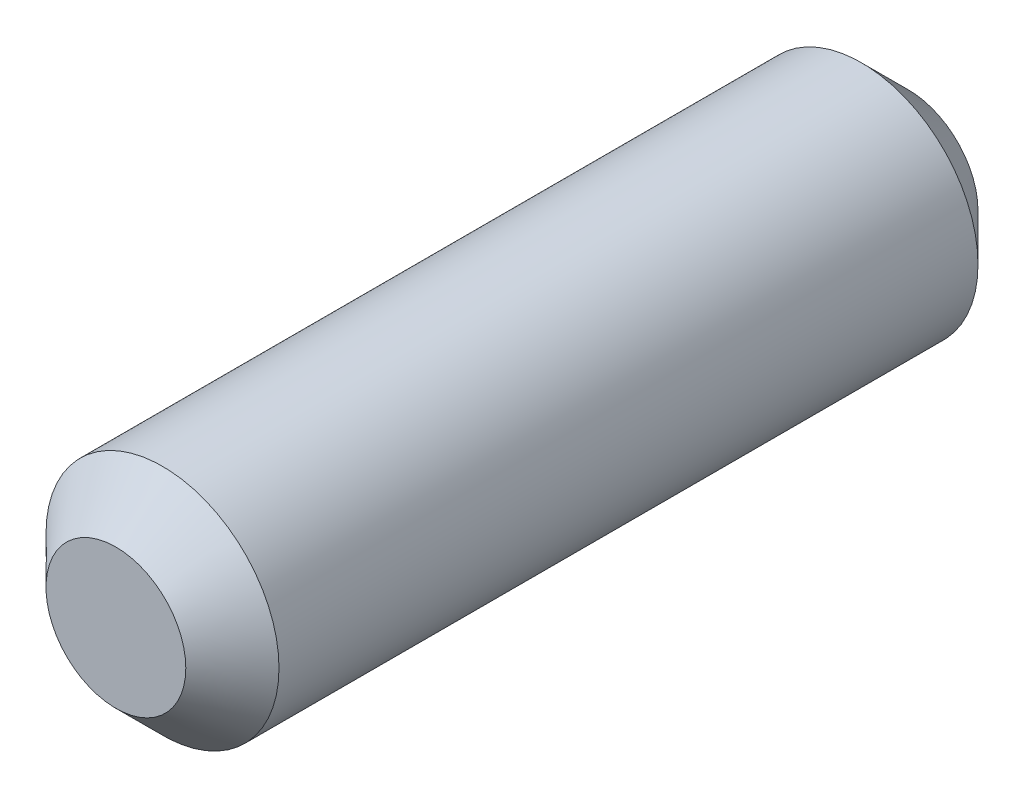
ISO-10303-21;
HEADER;
FILE_DESCRIPTION(('STEP AP214'),'2;1');
FILE_NAME('part.step','',(''),(''),'','','');
FILE_SCHEMA(('AUTOMOTIVE_DESIGN { 1 0 10303 214 1 1 1 1 }'));
ENDSEC;
DATA;
#1=APPLICATION_CONTEXT('core data for automotive mechanical design processes');
#2=APPLICATION_PROTOCOL_DEFINITION('international standard','automotive_design',2000,#1);
#3=PRODUCT_CONTEXT('',#1,'mechanical');
#4=PRODUCT('Part','Part','',(#3));
#5=PRODUCT_RELATED_PRODUCT_CATEGORY('part','',(#4));
#6=PRODUCT_DEFINITION_FORMATION('','',#4);
#7=PRODUCT_DEFINITION_CONTEXT('part definition',#1,'design');
#8=PRODUCT_DEFINITION('design','',#6,#7);
#9=PRODUCT_DEFINITION_SHAPE('','',#8);
#10=(LENGTH_UNIT() NAMED_UNIT(*) SI_UNIT(.MILLI.,.METRE.));
#11=(NAMED_UNIT(*) PLANE_ANGLE_UNIT() SI_UNIT($,.RADIAN.));
#12=(NAMED_UNIT(*) SI_UNIT($,.STERADIAN.) SOLID_ANGLE_UNIT());
#13=UNCERTAINTY_MEASURE_WITH_UNIT(LENGTH_MEASURE(1.E-05),#10,'distance_accuracy_value','');
#14=(GEOMETRIC_REPRESENTATION_CONTEXT(3) GLOBAL_UNCERTAINTY_ASSIGNED_CONTEXT((#13)) GLOBAL_UNIT_ASSIGNED_CONTEXT((#10,
#11,#12)) REPRESENTATION_CONTEXT('',''));
#15=CARTESIAN_POINT('',(0.,0.,0.));
#16=DIRECTION('',(0.,0.,1.));
#17=DIRECTION('',(1.,0.,0.));
#18=AXIS2_PLACEMENT_3D('',#15,#16,#17);
#19=CARTESIAN_POINT('',(-3.14378372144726,6.82868334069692,-8.5));
#20=DIRECTION('',(0.,0.,1.));
#21=DIRECTION('',(1.,0.,0.));
#22=AXIS2_PLACEMENT_3D('',#19,#20,#21);
#23=CYLINDRICAL_SURFACE('',#22,1.25);
#24=CARTESIAN_POINT('',(-3.14378372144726,6.82868334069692,-8.));
#25=DIRECTION('',(0.,0.,1.));
#26=DIRECTION('',(1.,0.,0.));
#27=AXIS2_PLACEMENT_3D('',#24,#25,#26);
#28=CIRCLE('',#27,1.25);
#29=CARTESIAN_POINT('',(-1.89378372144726,6.82868334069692,-8.));
#30=VERTEX_POINT('',#29);
#31=EDGE_CURVE('E46',#30,#30,#28,.T.);
#32=ORIENTED_EDGE('',*,*,#31,.T.);
#33=EDGE_LOOP('',(#32));
#34=FACE_BOUND('',#33,.T.);
#35=CARTESIAN_POINT('',(-3.14378372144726,6.82868334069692,-0.5));
#36=DIRECTION('',(0.,0.,1.));
#37=DIRECTION('',(1.,0.,0.));
#38=AXIS2_PLACEMENT_3D('',#35,#36,#37);
#39=CIRCLE('',#38,1.25);
#40=CARTESIAN_POINT('',(-1.89378372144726,6.82868334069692,-0.5));
#41=VERTEX_POINT('',#40);
#42=EDGE_CURVE('E50',#41,#41,#39,.F.);
#43=ORIENTED_EDGE('',*,*,#42,.T.);
#44=EDGE_LOOP('',(#43));
#45=FACE_BOUND('',#44,.T.);
#46=ADVANCED_FACE('F35',(#34,#45),#23,.T.);
#47=CARTESIAN_POINT('',(-3.14378372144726,6.82868334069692,-8.5));
#48=DIRECTION('',(0.,0.,1.));
#49=DIRECTION('',(1.,0.,0.));
#50=AXIS2_PLACEMENT_3D('',#47,#48,#49);
#51=PLANE('',#50);
#52=CARTESIAN_POINT('',(-3.14378372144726,6.82868334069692,-8.5));
#53=DIRECTION('',(0.,0.,1.));
#54=DIRECTION('',(1.,0.,0.));
#55=AXIS2_PLACEMENT_3D('',#52,#53,#54);
#56=CIRCLE('',#55,0.749999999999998);
#57=CARTESIAN_POINT('',(-2.39378372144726,6.82868334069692,-8.5));
#58=VERTEX_POINT('',#57);
#59=EDGE_CURVE('E42',#58,#58,#56,.F.);
#60=ORIENTED_EDGE('',*,*,#59,.T.);
#61=EDGE_LOOP('',(#60));
#62=FACE_BOUND('',#61,.T.);
#63=ADVANCED_FACE('F66',(#62),#51,.F.);
#64=CARTESIAN_POINT('',(-3.14378372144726,6.82868334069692,0.));
#65=DIRECTION('',(0.,0.,1.));
#66=DIRECTION('',(1.,0.,0.));
#67=AXIS2_PLACEMENT_3D('',#64,#65,#66);
#68=PLANE('',#67);
#69=CARTESIAN_POINT('',(-3.14378372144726,6.82868334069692,0.));
#70=DIRECTION('',(0.,0.,1.));
#71=DIRECTION('',(1.,0.,0.));
#72=AXIS2_PLACEMENT_3D('',#69,#70,#71);
#73=CIRCLE('',#72,0.750000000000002);
#74=CARTESIAN_POINT('',(-2.39378372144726,6.82868334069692,0.));
#75=VERTEX_POINT('',#74);
#76=EDGE_CURVE('E10',#75,#75,#73,.T.);
#77=ORIENTED_EDGE('',*,*,#76,.T.);
#78=EDGE_LOOP('',(#77));
#79=FACE_BOUND('',#78,.T.);
#80=ADVANCED_FACE('F63',(#79),#68,.T.);
#81=CARTESIAN_POINT('',(-3.14378372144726,6.82868334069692,-8.));
#82=DIRECTION('',(0.,0.,1.));
#83=DIRECTION('',(1.,0.,0.));
#84=AXIS2_PLACEMENT_3D('',#81,#82,#83);
#85=CONICAL_SURFACE('',#84,1.25,0.78539816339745);
#86=ORIENTED_EDGE('',*,*,#59,.F.);
#87=EDGE_LOOP('',(#86));
#88=FACE_BOUND('',#87,.T.);
#89=ORIENTED_EDGE('',*,*,#31,.F.);
#90=EDGE_LOOP('',(#89));
#91=FACE_BOUND('',#90,.T.);
#92=ADVANCED_FACE('F59',(#88,#91),#85,.T.);
#93=CARTESIAN_POINT('',(-3.14378372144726,6.82868334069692,0.));
#94=DIRECTION('',(0.,0.,-1.));
#95=DIRECTION('',(-1.,0.,0.));
#96=AXIS2_PLACEMENT_3D('',#93,#94,#95);
#97=CONICAL_SURFACE('',#96,0.750000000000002,0.785398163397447);
#98=ORIENTED_EDGE('',*,*,#42,.F.);
#99=EDGE_LOOP('',(#98));
#100=FACE_BOUND('',#99,.T.);
#101=ORIENTED_EDGE('',*,*,#76,.F.);
#102=EDGE_LOOP('',(#101));
#103=FACE_BOUND('',#102,.T.);
#104=ADVANCED_FACE('F37',(#100,#103),#97,.T.);
#105=CLOSED_SHELL('',(#46,#63,#80,#92,#104));
#106=MANIFOLD_SOLID_BREP('B2',#105);
#107=ADVANCED_BREP_SHAPE_REPRESENTATION('',(#18,#106),#14);
#108=SHAPE_DEFINITION_REPRESENTATION(#9,#107);
ENDSEC;
END-ISO-10303-21;
